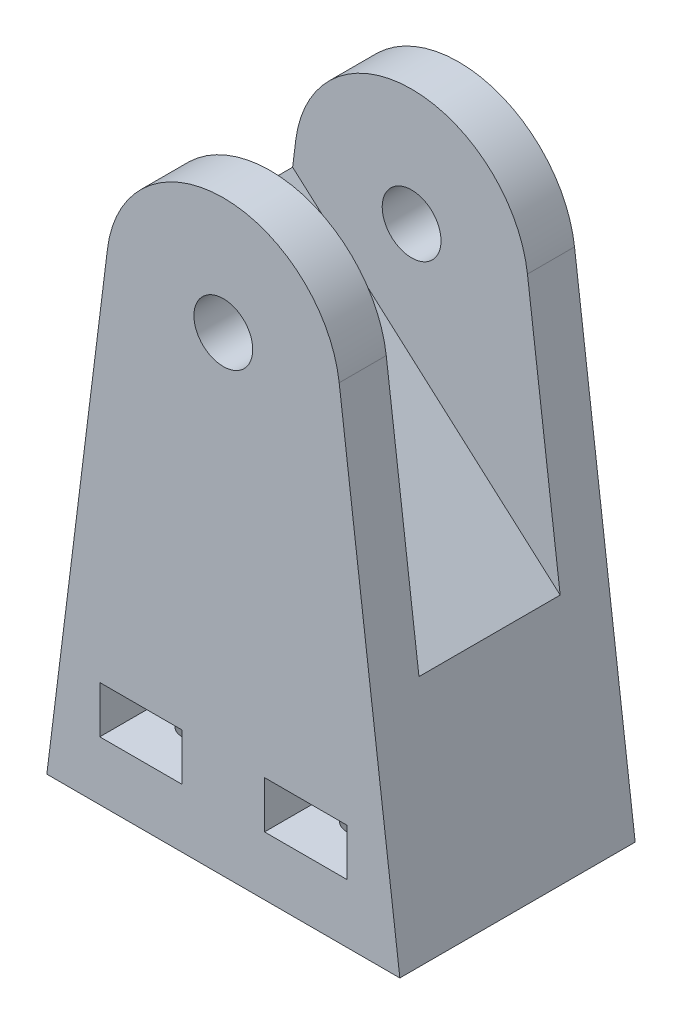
ISO-10303-21;
HEADER;
FILE_DESCRIPTION(('STEP AP214'),'2;1');
FILE_NAME('part.step','',(''),(''),'','','');
FILE_SCHEMA(('AUTOMOTIVE_DESIGN { 1 0 10303 214 1 1 1 1 }'));
ENDSEC;
DATA;
#1=APPLICATION_CONTEXT('core data for automotive mechanical design processes');
#2=APPLICATION_PROTOCOL_DEFINITION('international standard','automotive_design',2000,#1);
#3=PRODUCT_CONTEXT('',#1,'mechanical');
#4=PRODUCT('Part','Part','',(#3));
#5=PRODUCT_RELATED_PRODUCT_CATEGORY('part','',(#4));
#6=PRODUCT_DEFINITION_FORMATION('','',#4);
#7=PRODUCT_DEFINITION_CONTEXT('part definition',#1,'design');
#8=PRODUCT_DEFINITION('design','',#6,#7);
#9=PRODUCT_DEFINITION_SHAPE('','',#8);
#10=(LENGTH_UNIT() NAMED_UNIT(*) SI_UNIT(.MILLI.,.METRE.));
#11=(NAMED_UNIT(*) PLANE_ANGLE_UNIT() SI_UNIT($,.RADIAN.));
#12=(NAMED_UNIT(*) SI_UNIT($,.STERADIAN.) SOLID_ANGLE_UNIT());
#13=UNCERTAINTY_MEASURE_WITH_UNIT(LENGTH_MEASURE(1.E-05),#10,'distance_accuracy_value','');
#14=(GEOMETRIC_REPRESENTATION_CONTEXT(3) GLOBAL_UNCERTAINTY_ASSIGNED_CONTEXT((#13)) GLOBAL_UNIT_ASSIGNED_CONTEXT((#10,
#11,#12)) REPRESENTATION_CONTEXT('',''));
#15=CARTESIAN_POINT('',(0.,0.,0.));
#16=DIRECTION('',(0.,0.,1.));
#17=DIRECTION('',(1.,0.,0.));
#18=AXIS2_PLACEMENT_3D('',#15,#16,#17);
#19=CARTESIAN_POINT('',(0.,0.,20.));
#20=DIRECTION('',(0.,0.,1.));
#21=DIRECTION('',(1.,0.,0.));
#22=AXIS2_PLACEMENT_3D('',#19,#20,#21);
#23=PLANE('',#22);
#24=DIRECTION('',(0.,1.,0.));
#25=VECTOR('',#24,1.);
#26=CARTESIAN_POINT('',(-10.5,0.,20.));
#27=LINE('',#26,#25);
#28=CARTESIAN_POINT('',(-10.5,-15.,20.));
#29=VERTEX_POINT('',#28);
#30=CARTESIAN_POINT('',(-10.5,-11.,20.));
#31=VERTEX_POINT('',#30);
#32=EDGE_CURVE('E234',#29,#31,#27,.T.);
#33=ORIENTED_EDGE('',*,*,#32,.T.);
#34=DIRECTION('',(1.,0.,0.));
#35=VECTOR('',#34,1.);
#36=CARTESIAN_POINT('',(0.,-11.,20.));
#37=LINE('',#36,#35);
#38=CARTESIAN_POINT('',(-3.49999999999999,-11.,20.));
#39=VERTEX_POINT('',#38);
#40=EDGE_CURVE('E229',#31,#39,#37,.T.);
#41=ORIENTED_EDGE('',*,*,#40,.T.);
#42=DIRECTION('',(0.,1.,0.));
#43=VECTOR('',#42,1.);
#44=CARTESIAN_POINT('',(-3.49999999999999,0.,20.));
#45=LINE('',#44,#43);
#46=CARTESIAN_POINT('',(-3.49999999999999,-15.,20.));
#47=VERTEX_POINT('',#46);
#48=EDGE_CURVE('E232',#47,#39,#45,.T.);
#49=ORIENTED_EDGE('',*,*,#48,.F.);
#50=DIRECTION('',(1.,0.,0.));
#51=VECTOR('',#50,1.);
#52=CARTESIAN_POINT('',(0.,-15.,20.));
#53=LINE('',#52,#51);
#54=EDGE_CURVE('E222',#29,#47,#53,.T.);
#55=ORIENTED_EDGE('',*,*,#54,.F.);
#56=EDGE_LOOP('',(#33,#41,#49,#55));
#57=FACE_BOUND('',#56,.T.);
#58=DIRECTION('',(-0.124034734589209,0.992277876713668,0.));
#59=VECTOR('',#58,1.);
#60=CARTESIAN_POINT('',(12.3076923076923,1.53846153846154,20.));
#61=LINE('',#60,#59);
#62=CARTESIAN_POINT('',(15.,-20.,20.));
#63=VERTEX_POINT('',#62);
#64=CARTESIAN_POINT('',(9.84615384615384,21.2307692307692,20.));
#65=VERTEX_POINT('',#64);
#66=EDGE_CURVE('E322',#63,#65,#61,.T.);
#67=ORIENTED_EDGE('',*,*,#66,.T.);
#68=CARTESIAN_POINT('',(0.,20.,20.));
#69=DIRECTION('',(0.,0.,1.));
#70=DIRECTION('',(1.,0.,0.));
#71=AXIS2_PLACEMENT_3D('',#68,#69,#70);
#72=CIRCLE('',#71,9.92277876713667);
#73=CARTESIAN_POINT('',(-9.84615384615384,21.2307692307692,20.));
#74=VERTEX_POINT('',#73);
#75=EDGE_CURVE('E248',#65,#74,#72,.T.);
#76=ORIENTED_EDGE('',*,*,#75,.T.);
#77=DIRECTION('',(0.124034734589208,0.992277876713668,0.));
#78=VECTOR('',#77,1.);
#79=CARTESIAN_POINT('',(-12.3076923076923,1.53846153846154,20.));
#80=LINE('',#79,#78);
#81=CARTESIAN_POINT('',(-15.,-20.,20.));
#82=VERTEX_POINT('',#81);
#83=EDGE_CURVE('E316',#82,#74,#80,.T.);
#84=ORIENTED_EDGE('',*,*,#83,.F.);
#85=DIRECTION('',(-1.,0.,0.));
#86=VECTOR('',#85,1.);
#87=CARTESIAN_POINT('',(0.,-20.,20.));
#88=LINE('',#87,#86);
#89=EDGE_CURVE('E319',#63,#82,#88,.T.);
#90=ORIENTED_EDGE('',*,*,#89,.F.);
#91=EDGE_LOOP('',(#67,#76,#84,#90));
#92=FACE_BOUND('',#91,.T.);
#93=CARTESIAN_POINT('',(0.,20.,20.));
#94=DIRECTION('',(0.,0.,1.));
#95=DIRECTION('',(1.,0.,0.));
#96=AXIS2_PLACEMENT_3D('',#93,#94,#95);
#97=CIRCLE('',#96,2.5);
#98=CARTESIAN_POINT('',(2.5,20.,20.));
#99=VERTEX_POINT('',#98);
#100=EDGE_CURVE('E313',#99,#99,#97,.T.);
#101=ORIENTED_EDGE('',*,*,#100,.F.);
#102=EDGE_LOOP('',(#101));
#103=FACE_BOUND('',#102,.T.);
#104=DIRECTION('',(0.,1.,0.));
#105=VECTOR('',#104,1.);
#106=CARTESIAN_POINT('',(3.5,0.,20.));
#107=LINE('',#106,#105);
#108=CARTESIAN_POINT('',(3.5,-15.,20.));
#109=VERTEX_POINT('',#108);
#110=CARTESIAN_POINT('',(3.5,-11.,20.));
#111=VERTEX_POINT('',#110);
#112=EDGE_CURVE('E194',#109,#111,#107,.T.);
#113=ORIENTED_EDGE('',*,*,#112,.T.);
#114=DIRECTION('',(1.,0.,0.));
#115=VECTOR('',#114,1.);
#116=CARTESIAN_POINT('',(0.,-11.,20.));
#117=LINE('',#116,#115);
#118=CARTESIAN_POINT('',(10.5,-11.,20.));
#119=VERTEX_POINT('',#118);
#120=EDGE_CURVE('E189',#111,#119,#117,.T.);
#121=ORIENTED_EDGE('',*,*,#120,.T.);
#122=DIRECTION('',(0.,1.,0.));
#123=VECTOR('',#122,1.);
#124=CARTESIAN_POINT('',(10.5,0.,20.));
#125=LINE('',#124,#123);
#126=CARTESIAN_POINT('',(10.5,-15.,20.));
#127=VERTEX_POINT('',#126);
#128=EDGE_CURVE('E192',#127,#119,#125,.T.);
#129=ORIENTED_EDGE('',*,*,#128,.F.);
#130=DIRECTION('',(1.,0.,0.));
#131=VECTOR('',#130,1.);
#132=CARTESIAN_POINT('',(0.,-15.,20.));
#133=LINE('',#132,#131);
#134=EDGE_CURVE('E160',#109,#127,#133,.T.);
#135=ORIENTED_EDGE('',*,*,#134,.F.);
#136=EDGE_LOOP('',(#113,#121,#129,#135));
#137=FACE_BOUND('',#136,.T.);
#138=ADVANCED_FACE('F39',(#57,#92,#103,#137),#23,.T.);
#139=CARTESIAN_POINT('',(0.,0.,0.));
#140=DIRECTION('',(0.,0.,1.));
#141=DIRECTION('',(1.,0.,0.));
#142=AXIS2_PLACEMENT_3D('',#139,#140,#141);
#143=PLANE('',#142);
#144=DIRECTION('',(-1.,0.,0.));
#145=VECTOR('',#144,1.);
#146=CARTESIAN_POINT('',(0.,-11.,0.));
#147=LINE('',#146,#145);
#148=CARTESIAN_POINT('',(-3.49999999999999,-11.,0.));
#149=VERTEX_POINT('',#148);
#150=CARTESIAN_POINT('',(-10.5,-11.,0.));
#151=VERTEX_POINT('',#150);
#152=EDGE_CURVE('E197',#149,#151,#147,.T.);
#153=ORIENTED_EDGE('',*,*,#152,.T.);
#154=DIRECTION('',(0.,-1.,0.));
#155=VECTOR('',#154,1.);
#156=CARTESIAN_POINT('',(-10.5,0.,0.));
#157=LINE('',#156,#155);
#158=CARTESIAN_POINT('',(-10.5,-15.,0.));
#159=VERTEX_POINT('',#158);
#160=EDGE_CURVE('E206',#151,#159,#157,.T.);
#161=ORIENTED_EDGE('',*,*,#160,.T.);
#162=DIRECTION('',(-1.,0.,0.));
#163=VECTOR('',#162,1.);
#164=CARTESIAN_POINT('',(0.,-15.,0.));
#165=LINE('',#164,#163);
#166=CARTESIAN_POINT('',(-3.49999999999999,-15.,0.));
#167=VERTEX_POINT('',#166);
#168=EDGE_CURVE('E203',#167,#159,#165,.T.);
#169=ORIENTED_EDGE('',*,*,#168,.F.);
#170=DIRECTION('',(0.,-1.,0.));
#171=VECTOR('',#170,1.);
#172=CARTESIAN_POINT('',(-3.49999999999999,0.,0.));
#173=LINE('',#172,#171);
#174=EDGE_CURVE('E200',#149,#167,#173,.T.);
#175=ORIENTED_EDGE('',*,*,#174,.F.);
#176=EDGE_LOOP('',(#153,#161,#169,#175));
#177=FACE_BOUND('',#176,.T.);
#178=CARTESIAN_POINT('',(0.,20.,0.));
#179=DIRECTION('',(0.,0.,-1.));
#180=DIRECTION('',(-1.,0.,0.));
#181=AXIS2_PLACEMENT_3D('',#178,#179,#180);
#182=CIRCLE('',#181,9.92277876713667);
#183=CARTESIAN_POINT('',(-9.84615384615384,21.2307692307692,0.));
#184=VERTEX_POINT('',#183);
#185=CARTESIAN_POINT('',(9.84615384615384,21.2307692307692,0.));
#186=VERTEX_POINT('',#185);
#187=EDGE_CURVE('E258',#184,#186,#182,.T.);
#188=ORIENTED_EDGE('',*,*,#187,.T.);
#189=DIRECTION('',(-0.124034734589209,0.992277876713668,0.));
#190=VECTOR('',#189,1.);
#191=CARTESIAN_POINT('',(12.3076923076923,1.53846153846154,0.));
#192=LINE('',#191,#190);
#193=CARTESIAN_POINT('',(15.,-20.,0.));
#194=VERTEX_POINT('',#193);
#195=EDGE_CURVE('E317',#194,#186,#192,.T.);
#196=ORIENTED_EDGE('',*,*,#195,.F.);
#197=DIRECTION('',(-1.,0.,0.));
#198=VECTOR('',#197,1.);
#199=CARTESIAN_POINT('',(0.,-20.,0.));
#200=LINE('',#199,#198);
#201=CARTESIAN_POINT('',(-15.,-20.,0.));
#202=VERTEX_POINT('',#201);
#203=EDGE_CURVE('E328',#194,#202,#200,.T.);
#204=ORIENTED_EDGE('',*,*,#203,.T.);
#205=DIRECTION('',(0.124034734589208,0.992277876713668,0.));
#206=VECTOR('',#205,1.);
#207=CARTESIAN_POINT('',(-12.3076923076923,1.53846153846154,0.));
#208=LINE('',#207,#206);
#209=EDGE_CURVE('E326',#202,#184,#208,.T.);
#210=ORIENTED_EDGE('',*,*,#209,.T.);
#211=EDGE_LOOP('',(#188,#196,#204,#210));
#212=FACE_BOUND('',#211,.T.);
#213=CARTESIAN_POINT('',(0.,20.,0.));
#214=DIRECTION('',(0.,0.,1.));
#215=DIRECTION('',(1.,0.,0.));
#216=AXIS2_PLACEMENT_3D('',#213,#214,#215);
#217=CIRCLE('',#216,2.5);
#218=CARTESIAN_POINT('',(2.5,20.,0.));
#219=VERTEX_POINT('',#218);
#220=EDGE_CURVE('E312',#219,#219,#217,.T.);
#221=ORIENTED_EDGE('',*,*,#220,.T.);
#222=EDGE_LOOP('',(#221));
#223=FACE_BOUND('',#222,.T.);
#224=DIRECTION('',(-1.,0.,0.));
#225=VECTOR('',#224,1.);
#226=CARTESIAN_POINT('',(0.,-11.,0.));
#227=LINE('',#226,#225);
#228=CARTESIAN_POINT('',(10.5,-11.,0.));
#229=VERTEX_POINT('',#228);
#230=CARTESIAN_POINT('',(3.5,-11.,0.));
#231=VERTEX_POINT('',#230);
#232=EDGE_CURVE('E64',#229,#231,#227,.T.);
#233=ORIENTED_EDGE('',*,*,#232,.T.);
#234=DIRECTION('',(0.,-1.,0.));
#235=VECTOR('',#234,1.);
#236=CARTESIAN_POINT('',(3.5,0.,0.));
#237=LINE('',#236,#235);
#238=CARTESIAN_POINT('',(3.5,-15.,0.));
#239=VERTEX_POINT('',#238);
#240=EDGE_CURVE('E172',#231,#239,#237,.T.);
#241=ORIENTED_EDGE('',*,*,#240,.T.);
#242=DIRECTION('',(-1.,0.,0.));
#243=VECTOR('',#242,1.);
#244=CARTESIAN_POINT('',(0.,-15.,0.));
#245=LINE('',#244,#243);
#246=CARTESIAN_POINT('',(10.5,-15.,0.));
#247=VERTEX_POINT('',#246);
#248=EDGE_CURVE('E157',#247,#239,#245,.T.);
#249=ORIENTED_EDGE('',*,*,#248,.F.);
#250=DIRECTION('',(0.,-1.,0.));
#251=VECTOR('',#250,1.);
#252=CARTESIAN_POINT('',(10.5,0.,0.));
#253=LINE('',#252,#251);
#254=EDGE_CURVE('E166',#229,#247,#253,.T.);
#255=ORIENTED_EDGE('',*,*,#254,.F.);
#256=EDGE_LOOP('',(#233,#241,#249,#255));
#257=FACE_BOUND('',#256,.T.);
#258=ADVANCED_FACE('F170',(#177,#212,#223,#257),#143,.F.);
#259=CARTESIAN_POINT('',(0.,46.,4.));
#260=DIRECTION('',(0.,0.,-1.));
#261=DIRECTION('',(-1.,0.,0.));
#262=AXIS2_PLACEMENT_3D('',#259,#260,#261);
#263=PLANE('',#262);
#264=CARTESIAN_POINT('',(0.,20.,4.));
#265=DIRECTION('',(0.,0.,-1.));
#266=DIRECTION('',(-1.,0.,0.));
#267=AXIS2_PLACEMENT_3D('',#264,#265,#266);
#268=CIRCLE('',#267,2.5);
#269=CARTESIAN_POINT('',(-2.5,20.,4.));
#270=VERTEX_POINT('',#269);
#271=EDGE_CURVE('E309',#270,#270,#268,.T.);
#272=ORIENTED_EDGE('',*,*,#271,.T.);
#273=EDGE_LOOP('',(#272));
#274=FACE_BOUND('',#273,.T.);
#275=DIRECTION('',(-0.748812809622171,0.662781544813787,0.));
#276=VECTOR('',#275,1.);
#277=CARTESIAN_POINT('',(5.04675335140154,5.70183884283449,4.));
#278=LINE('',#277,#276);
#279=CARTESIAN_POINT('',(12.6258069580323,-1.00645566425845,4.));
#280=VERTEX_POINT('',#279);
#281=CARTESIAN_POINT('',(-10.1103118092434,19.1175055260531,4.));
#282=VERTEX_POINT('',#281);
#283=EDGE_CURVE('E237',#280,#282,#278,.T.);
#284=ORIENTED_EDGE('',*,*,#283,.F.);
#285=DIRECTION('',(0.124034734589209,-0.992277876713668,0.));
#286=VECTOR('',#285,1.);
#287=CARTESIAN_POINT('',(12.3076923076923,1.53846153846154,4.));
#288=LINE('',#287,#286);
#289=CARTESIAN_POINT('',(9.84615384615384,21.2307692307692,4.));
#290=VERTEX_POINT('',#289);
#291=EDGE_CURVE('E304',#290,#280,#288,.T.);
#292=ORIENTED_EDGE('',*,*,#291,.F.);
#293=CARTESIAN_POINT('',(0.,20.,4.));
#294=DIRECTION('',(0.,0.,-1.));
#295=DIRECTION('',(-1.,0.,0.));
#296=AXIS2_PLACEMENT_3D('',#293,#294,#295);
#297=CIRCLE('',#296,9.92277876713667);
#298=CARTESIAN_POINT('',(-9.84615384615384,21.2307692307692,4.));
#299=VERTEX_POINT('',#298);
#300=EDGE_CURVE('E261',#299,#290,#297,.T.);
#301=ORIENTED_EDGE('',*,*,#300,.F.);
#302=DIRECTION('',(-0.124034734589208,-0.992277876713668,0.));
#303=VECTOR('',#302,1.);
#304=CARTESIAN_POINT('',(-12.3076923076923,1.53846153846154,4.));
#305=LINE('',#304,#303);
#306=EDGE_CURVE('E307',#299,#282,#305,.T.);
#307=ORIENTED_EDGE('',*,*,#306,.T.);
#308=EDGE_LOOP('',(#284,#292,#301,#307));
#309=FACE_BOUND('',#308,.T.);
#310=ADVANCED_FACE('F382',(#274,#309),#263,.F.);
#311=CARTESIAN_POINT('',(0.,46.,16.));
#312=DIRECTION('',(0.,0.,-1.));
#313=DIRECTION('',(-1.,0.,0.));
#314=AXIS2_PLACEMENT_3D('',#311,#312,#313);
#315=PLANE('',#314);
#316=CARTESIAN_POINT('',(0.,20.,16.));
#317=DIRECTION('',(0.,0.,-1.));
#318=DIRECTION('',(-1.,0.,0.));
#319=AXIS2_PLACEMENT_3D('',#316,#317,#318);
#320=CIRCLE('',#319,2.5);
#321=CARTESIAN_POINT('',(-2.5,20.,16.));
#322=VERTEX_POINT('',#321);
#323=EDGE_CURVE('E301',#322,#322,#320,.T.);
#324=ORIENTED_EDGE('',*,*,#323,.F.);
#325=EDGE_LOOP('',(#324));
#326=FACE_BOUND('',#325,.T.);
#327=DIRECTION('',(0.124034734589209,-0.992277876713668,0.));
#328=VECTOR('',#327,1.);
#329=CARTESIAN_POINT('',(12.3076923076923,1.53846153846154,16.));
#330=LINE('',#329,#328);
#331=CARTESIAN_POINT('',(9.84615384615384,21.2307692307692,16.));
#332=VERTEX_POINT('',#331);
#333=CARTESIAN_POINT('',(12.6258069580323,-1.00645566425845,16.));
#334=VERTEX_POINT('',#333);
#335=EDGE_CURVE('E294',#332,#334,#330,.T.);
#336=ORIENTED_EDGE('',*,*,#335,.T.);
#337=DIRECTION('',(-0.748812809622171,0.662781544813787,0.));
#338=VECTOR('',#337,1.);
#339=CARTESIAN_POINT('',(5.04675335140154,5.70183884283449,16.));
#340=LINE('',#339,#338);
#341=CARTESIAN_POINT('',(-10.1103118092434,19.1175055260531,16.));
#342=VERTEX_POINT('',#341);
#343=EDGE_CURVE('E238',#334,#342,#340,.T.);
#344=ORIENTED_EDGE('',*,*,#343,.T.);
#345=DIRECTION('',(-0.124034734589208,-0.992277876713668,0.));
#346=VECTOR('',#345,1.);
#347=CARTESIAN_POINT('',(-12.3076923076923,1.53846153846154,16.));
#348=LINE('',#347,#346);
#349=CARTESIAN_POINT('',(-9.84615384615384,21.2307692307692,16.));
#350=VERTEX_POINT('',#349);
#351=EDGE_CURVE('E298',#350,#342,#348,.T.);
#352=ORIENTED_EDGE('',*,*,#351,.F.);
#353=CARTESIAN_POINT('',(0.,20.,16.));
#354=DIRECTION('',(0.,0.,1.));
#355=DIRECTION('',(1.,0.,0.));
#356=AXIS2_PLACEMENT_3D('',#353,#354,#355);
#357=CIRCLE('',#356,9.92277876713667);
#358=EDGE_CURVE('E249',#332,#350,#357,.T.);
#359=ORIENTED_EDGE('',*,*,#358,.F.);
#360=EDGE_LOOP('',(#336,#344,#352,#359));
#361=FACE_BOUND('',#360,.T.);
#362=ADVANCED_FACE('F388',(#326,#361),#315,.T.);
#363=CARTESIAN_POINT('',(0.,20.,20.));
#364=DIRECTION('',(0.,0.,-1.));
#365=DIRECTION('',(-1.,0.,0.));
#366=AXIS2_PLACEMENT_3D('',#363,#364,#365);
#367=CYLINDRICAL_SURFACE('',#366,2.5);
#368=ORIENTED_EDGE('',*,*,#100,.T.);
#369=EDGE_LOOP('',(#368));
#370=FACE_BOUND('',#369,.T.);
#371=ORIENTED_EDGE('',*,*,#323,.T.);
#372=EDGE_LOOP('',(#371));
#373=FACE_BOUND('',#372,.T.);
#374=ADVANCED_FACE('F446',(#370,#373),#367,.F.);
#375=CARTESIAN_POINT('',(-12.3076923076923,1.53846153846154,20.));
#376=DIRECTION('',(-0.992277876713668,0.124034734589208,0.));
#377=DIRECTION('',(-0.124034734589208,-0.992277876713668,0.));
#378=AXIS2_PLACEMENT_3D('',#375,#376,#377);
#379=PLANE('',#378);
#380=ORIENTED_EDGE('',*,*,#83,.T.);
#381=DIRECTION('',(0.,0.,1.));
#382=VECTOR('',#381,1.);
#383=CARTESIAN_POINT('',(-9.84615384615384,21.2307692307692,16.));
#384=LINE('',#383,#382);
#385=EDGE_CURVE('E255',#350,#74,#384,.T.);
#386=ORIENTED_EDGE('',*,*,#385,.F.);
#387=ORIENTED_EDGE('',*,*,#351,.T.);
#388=DIRECTION('',(0.,0.,-1.));
#389=VECTOR('',#388,1.);
#390=CARTESIAN_POINT('',(-10.1103118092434,19.1175055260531,16.));
#391=LINE('',#390,#389);
#392=EDGE_CURVE('E240',#342,#282,#391,.T.);
#393=ORIENTED_EDGE('',*,*,#392,.T.);
#394=ORIENTED_EDGE('',*,*,#306,.F.);
#395=DIRECTION('',(0.,0.,-1.));
#396=VECTOR('',#395,1.);
#397=CARTESIAN_POINT('',(-9.84615384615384,21.2307692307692,4.));
#398=LINE('',#397,#396);
#399=EDGE_CURVE('E264',#299,#184,#398,.T.);
#400=ORIENTED_EDGE('',*,*,#399,.T.);
#401=ORIENTED_EDGE('',*,*,#209,.F.);
#402=DIRECTION('',(0.,0.,-1.));
#403=VECTOR('',#402,1.);
#404=CARTESIAN_POINT('',(-15.,-20.,20.));
#405=LINE('',#404,#403);
#406=EDGE_CURVE('E12',#82,#202,#405,.T.);
#407=ORIENTED_EDGE('',*,*,#406,.F.);
#408=EDGE_LOOP('',(#380,#386,#387,#393,#394,#400,#401,#407));
#409=FACE_BOUND('',#408,.T.);
#410=ADVANCED_FACE('F359',(#409),#379,.T.);
#411=CARTESIAN_POINT('',(0.,-20.,20.));
#412=DIRECTION('',(0.,-1.,0.));
#413=DIRECTION('',(0.,0.,-1.));
#414=AXIS2_PLACEMENT_3D('',#411,#412,#413);
#415=PLANE('',#414);
#416=CARTESIAN_POINT('',(7.00000000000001,-20.,15.));
#417=DIRECTION('',(0.,-1.,0.));
#418=DIRECTION('',(0.,0.,-1.));
#419=AXIS2_PLACEMENT_3D('',#416,#417,#418);
#420=CIRCLE('',#419,1.5);
#421=CARTESIAN_POINT('',(7.00000000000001,-20.,13.5));
#422=VERTEX_POINT('',#421);
#423=EDGE_CURVE('E270',#422,#422,#420,.T.);
#424=ORIENTED_EDGE('',*,*,#423,.F.);
#425=EDGE_LOOP('',(#424));
#426=FACE_BOUND('',#425,.T.);
#427=CARTESIAN_POINT('',(7.00000000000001,-20.,5.));
#428=DIRECTION('',(0.,-1.,0.));
#429=DIRECTION('',(0.,0.,-1.));
#430=AXIS2_PLACEMENT_3D('',#427,#428,#429);
#431=CIRCLE('',#430,1.5);
#432=CARTESIAN_POINT('',(7.00000000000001,-20.,3.5));
#433=VERTEX_POINT('',#432);
#434=EDGE_CURVE('E276',#433,#433,#431,.T.);
#435=ORIENTED_EDGE('',*,*,#434,.F.);
#436=EDGE_LOOP('',(#435));
#437=FACE_BOUND('',#436,.T.);
#438=CARTESIAN_POINT('',(-6.99999999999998,-20.,5.));
#439=DIRECTION('',(0.,-1.,0.));
#440=DIRECTION('',(0.,0.,-1.));
#441=AXIS2_PLACEMENT_3D('',#438,#439,#440);
#442=CIRCLE('',#441,1.5);
#443=CARTESIAN_POINT('',(-6.99999999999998,-20.,3.5));
#444=VERTEX_POINT('',#443);
#445=EDGE_CURVE('E282',#444,#444,#442,.T.);
#446=ORIENTED_EDGE('',*,*,#445,.F.);
#447=EDGE_LOOP('',(#446));
#448=FACE_BOUND('',#447,.T.);
#449=CARTESIAN_POINT('',(-6.99999999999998,-20.,15.));
#450=DIRECTION('',(0.,-1.,0.));
#451=DIRECTION('',(0.,0.,-1.));
#452=AXIS2_PLACEMENT_3D('',#449,#450,#451);
#453=CIRCLE('',#452,1.5);
#454=CARTESIAN_POINT('',(-6.99999999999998,-20.,13.5));
#455=VERTEX_POINT('',#454);
#456=EDGE_CURVE('E288',#455,#455,#453,.T.);
#457=ORIENTED_EDGE('',*,*,#456,.F.);
#458=EDGE_LOOP('',(#457));
#459=FACE_BOUND('',#458,.T.);
#460=ORIENTED_EDGE('',*,*,#203,.F.);
#461=DIRECTION('',(0.,0.,-1.));
#462=VECTOR('',#461,1.);
#463=CARTESIAN_POINT('',(15.,-20.,20.));
#464=LINE('',#463,#462);
#465=EDGE_CURVE('E48',#63,#194,#464,.T.);
#466=ORIENTED_EDGE('',*,*,#465,.F.);
#467=ORIENTED_EDGE('',*,*,#89,.T.);
#468=ORIENTED_EDGE('',*,*,#406,.T.);
#469=EDGE_LOOP('',(#460,#466,#467,#468));
#470=FACE_BOUND('',#469,.T.);
#471=ADVANCED_FACE('F356',(#426,#437,#448,#459,#470),#415,.T.);
#472=ORIENTED_EDGE('',*,*,#271,.F.);
#473=EDGE_LOOP('',(#472));
#474=FACE_BOUND('',#473,.T.);
#475=ORIENTED_EDGE('',*,*,#220,.F.);
#476=EDGE_LOOP('',(#475));
#477=FACE_BOUND('',#476,.T.);
#478=ADVANCED_FACE('F41',(#474,#477),#367,.F.);
#479=CARTESIAN_POINT('',(12.3076923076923,1.53846153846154,20.));
#480=DIRECTION('',(-0.992277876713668,-0.124034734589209,0.));
#481=DIRECTION('',(0.124034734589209,-0.992277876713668,0.));
#482=AXIS2_PLACEMENT_3D('',#479,#480,#481);
#483=PLANE('',#482);
#484=DIRECTION('',(0.,0.,-1.));
#485=VECTOR('',#484,1.);
#486=CARTESIAN_POINT('',(12.6258069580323,-1.00645566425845,16.));
#487=LINE('',#486,#485);
#488=EDGE_CURVE('E245',#334,#280,#487,.T.);
#489=ORIENTED_EDGE('',*,*,#488,.F.);
#490=ORIENTED_EDGE('',*,*,#335,.F.);
#491=DIRECTION('',(0.,0.,1.));
#492=VECTOR('',#491,1.);
#493=CARTESIAN_POINT('',(9.84615384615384,21.2307692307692,16.));
#494=LINE('',#493,#492);
#495=EDGE_CURVE('E252',#332,#65,#494,.T.);
#496=ORIENTED_EDGE('',*,*,#495,.T.);
#497=ORIENTED_EDGE('',*,*,#66,.F.);
#498=ORIENTED_EDGE('',*,*,#465,.T.);
#499=ORIENTED_EDGE('',*,*,#195,.T.);
#500=DIRECTION('',(0.,0.,-1.));
#501=VECTOR('',#500,1.);
#502=CARTESIAN_POINT('',(9.84615384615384,21.2307692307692,4.));
#503=LINE('',#502,#501);
#504=EDGE_CURVE('E267',#290,#186,#503,.T.);
#505=ORIENTED_EDGE('',*,*,#504,.F.);
#506=ORIENTED_EDGE('',*,*,#291,.T.);
#507=EDGE_LOOP('',(#489,#490,#496,#497,#498,#499,#505,#506));
#508=FACE_BOUND('',#507,.T.);
#509=ADVANCED_FACE('F376',(#508),#483,.F.);
#510=CARTESIAN_POINT('',(-6.99999999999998,0.,15.));
#511=DIRECTION('',(0.,-1.,0.));
#512=DIRECTION('',(0.,0.,-1.));
#513=AXIS2_PLACEMENT_3D('',#510,#511,#512);
#514=CYLINDRICAL_SURFACE('',#513,1.5);
#515=CARTESIAN_POINT('',(-6.99999999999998,-15.,15.));
#516=DIRECTION('',(0.,-1.,0.));
#517=DIRECTION('',(0.,0.,-1.));
#518=AXIS2_PLACEMENT_3D('',#515,#516,#517);
#519=CIRCLE('',#518,1.5);
#520=CARTESIAN_POINT('',(-6.99999999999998,-15.,13.5));
#521=VERTEX_POINT('',#520);
#522=EDGE_CURVE('E219',#521,#521,#519,.F.);
#523=ORIENTED_EDGE('',*,*,#522,.T.);
#524=EDGE_LOOP('',(#523));
#525=FACE_BOUND('',#524,.T.);
#526=ORIENTED_EDGE('',*,*,#456,.T.);
#527=EDGE_LOOP('',(#526));
#528=FACE_BOUND('',#527,.T.);
#529=ADVANCED_FACE('F443',(#525,#528),#514,.F.);
#530=CARTESIAN_POINT('',(-6.99999999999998,0.,5.));
#531=DIRECTION('',(0.,-1.,0.));
#532=DIRECTION('',(0.,0.,-1.));
#533=AXIS2_PLACEMENT_3D('',#530,#531,#532);
#534=CYLINDRICAL_SURFACE('',#533,1.5);
#535=CARTESIAN_POINT('',(-6.99999999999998,-15.,5.));
#536=DIRECTION('',(0.,-1.,0.));
#537=DIRECTION('',(0.,0.,-1.));
#538=AXIS2_PLACEMENT_3D('',#535,#536,#537);
#539=CIRCLE('',#538,1.5);
#540=CARTESIAN_POINT('',(-6.99999999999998,-15.,3.5));
#541=VERTEX_POINT('',#540);
#542=EDGE_CURVE('E212',#541,#541,#539,.F.);
#543=ORIENTED_EDGE('',*,*,#542,.T.);
#544=EDGE_LOOP('',(#543));
#545=FACE_BOUND('',#544,.T.);
#546=ORIENTED_EDGE('',*,*,#445,.T.);
#547=EDGE_LOOP('',(#546));
#548=FACE_BOUND('',#547,.T.);
#549=ADVANCED_FACE('F351',(#545,#548),#534,.F.);
#550=CARTESIAN_POINT('',(7.00000000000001,0.,5.));
#551=DIRECTION('',(0.,-1.,0.));
#552=DIRECTION('',(0.,0.,-1.));
#553=AXIS2_PLACEMENT_3D('',#550,#551,#552);
#554=CYLINDRICAL_SURFACE('',#553,1.5);
#555=CARTESIAN_POINT('',(7.00000000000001,-15.,5.));
#556=DIRECTION('',(0.,-1.,0.));
#557=DIRECTION('',(0.,0.,-1.));
#558=AXIS2_PLACEMENT_3D('',#555,#556,#557);
#559=CIRCLE('',#558,1.5);
#560=CARTESIAN_POINT('',(7.00000000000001,-15.,3.5));
#561=VERTEX_POINT('',#560);
#562=EDGE_CURVE('E182',#561,#561,#559,.F.);
#563=ORIENTED_EDGE('',*,*,#562,.T.);
#564=EDGE_LOOP('',(#563));
#565=FACE_BOUND('',#564,.T.);
#566=ORIENTED_EDGE('',*,*,#434,.T.);
#567=EDGE_LOOP('',(#566));
#568=FACE_BOUND('',#567,.T.);
#569=ADVANCED_FACE('F348',(#565,#568),#554,.F.);
#570=CARTESIAN_POINT('',(7.00000000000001,0.,15.));
#571=DIRECTION('',(0.,-1.,0.));
#572=DIRECTION('',(0.,0.,-1.));
#573=AXIS2_PLACEMENT_3D('',#570,#571,#572);
#574=CYLINDRICAL_SURFACE('',#573,1.5);
#575=CARTESIAN_POINT('',(7.00000000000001,-15.,15.));
#576=DIRECTION('',(0.,-1.,0.));
#577=DIRECTION('',(0.,0.,-1.));
#578=AXIS2_PLACEMENT_3D('',#575,#576,#577);
#579=CIRCLE('',#578,1.5);
#580=CARTESIAN_POINT('',(7.00000000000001,-15.,13.5));
#581=VERTEX_POINT('',#580);
#582=EDGE_CURVE('E179',#581,#581,#579,.F.);
#583=ORIENTED_EDGE('',*,*,#582,.T.);
#584=EDGE_LOOP('',(#583));
#585=FACE_BOUND('',#584,.T.);
#586=ORIENTED_EDGE('',*,*,#423,.T.);
#587=EDGE_LOOP('',(#586));
#588=FACE_BOUND('',#587,.T.);
#589=ADVANCED_FACE('F339',(#585,#588),#574,.F.);
#590=CARTESIAN_POINT('',(0.,20.,4.));
#591=DIRECTION('',(0.,0.,-1.));
#592=DIRECTION('',(-1.,0.,0.));
#593=AXIS2_PLACEMENT_3D('',#590,#591,#592);
#594=CYLINDRICAL_SURFACE('',#593,9.92277876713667);
#595=ORIENTED_EDGE('',*,*,#187,.F.);
#596=ORIENTED_EDGE('',*,*,#399,.F.);
#597=ORIENTED_EDGE('',*,*,#300,.T.);
#598=ORIENTED_EDGE('',*,*,#504,.T.);
#599=EDGE_LOOP('',(#595,#596,#597,#598));
#600=FACE_BOUND('',#599,.T.);
#601=ADVANCED_FACE('F378',(#600),#594,.T.);
#602=CARTESIAN_POINT('',(0.,20.,16.));
#603=DIRECTION('',(0.,0.,1.));
#604=DIRECTION('',(1.,0.,0.));
#605=AXIS2_PLACEMENT_3D('',#602,#603,#604);
#606=CYLINDRICAL_SURFACE('',#605,9.92277876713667);
#607=ORIENTED_EDGE('',*,*,#75,.F.);
#608=ORIENTED_EDGE('',*,*,#495,.F.);
#609=ORIENTED_EDGE('',*,*,#358,.T.);
#610=ORIENTED_EDGE('',*,*,#385,.T.);
#611=EDGE_LOOP('',(#607,#608,#609,#610));
#612=FACE_BOUND('',#611,.T.);
#613=ADVANCED_FACE('F396',(#612),#606,.T.);
#614=CARTESIAN_POINT('',(5.04675335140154,5.70183884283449,16.));
#615=DIRECTION('',(-0.662781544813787,-0.748812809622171,0.));
#616=DIRECTION('',(0.748812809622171,-0.662781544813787,0.));
#617=AXIS2_PLACEMENT_3D('',#614,#615,#616);
#618=PLANE('',#617);
#619=ORIENTED_EDGE('',*,*,#283,.T.);
#620=ORIENTED_EDGE('',*,*,#392,.F.);
#621=ORIENTED_EDGE('',*,*,#343,.F.);
#622=ORIENTED_EDGE('',*,*,#488,.T.);
#623=EDGE_LOOP('',(#619,#620,#621,#622));
#624=FACE_BOUND('',#623,.T.);
#625=ADVANCED_FACE('F385',(#624),#618,.F.);
#626=CARTESIAN_POINT('',(0.,-11.,24.));
#627=DIRECTION('',(0.,-1.,0.));
#628=DIRECTION('',(0.,0.,-1.));
#629=AXIS2_PLACEMENT_3D('',#626,#627,#628);
#630=PLANE('',#629);
#631=CARTESIAN_POINT('',(-6.99999999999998,-11.,5.));
#632=DIRECTION('',(0.,-1.,0.));
#633=DIRECTION('',(0.,0.,-1.));
#634=AXIS2_PLACEMENT_3D('',#631,#632,#633);
#635=CIRCLE('',#634,1.5);
#636=CARTESIAN_POINT('',(-6.99999999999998,-11.,3.5));
#637=VERTEX_POINT('',#636);
#638=EDGE_CURVE('E225',#637,#637,#635,.F.);
#639=ORIENTED_EDGE('',*,*,#638,.T.);
#640=EDGE_LOOP('',(#639));
#641=FACE_BOUND('',#640,.T.);
#642=DIRECTION('',(0.,0.,-1.));
#643=VECTOR('',#642,1.);
#644=CARTESIAN_POINT('',(-10.5,-11.,24.));
#645=LINE('',#644,#643);
#646=EDGE_CURVE('E210',#31,#151,#645,.T.);
#647=ORIENTED_EDGE('',*,*,#646,.T.);
#648=ORIENTED_EDGE('',*,*,#152,.F.);
#649=DIRECTION('',(0.,0.,-1.));
#650=VECTOR('',#649,1.);
#651=CARTESIAN_POINT('',(-3.49999999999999,-11.,24.));
#652=LINE('',#651,#650);
#653=EDGE_CURVE('E209',#39,#149,#652,.T.);
#654=ORIENTED_EDGE('',*,*,#653,.F.);
#655=ORIENTED_EDGE('',*,*,#40,.F.);
#656=EDGE_LOOP('',(#647,#648,#654,#655));
#657=FACE_BOUND('',#656,.T.);
#658=CARTESIAN_POINT('',(-6.99999999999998,-11.,15.));
#659=DIRECTION('',(0.,-1.,0.));
#660=DIRECTION('',(0.,0.,-1.));
#661=AXIS2_PLACEMENT_3D('',#658,#659,#660);
#662=CIRCLE('',#661,1.5);
#663=CARTESIAN_POINT('',(-6.99999999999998,-11.,13.5));
#664=VERTEX_POINT('',#663);
#665=EDGE_CURVE('E226',#664,#664,#662,.F.);
#666=ORIENTED_EDGE('',*,*,#665,.T.);
#667=EDGE_LOOP('',(#666));
#668=FACE_BOUND('',#667,.T.);
#669=ADVANCED_FACE('F571',(#641,#657,#668),#630,.T.);
#670=CARTESIAN_POINT('',(0.,-15.,24.));
#671=DIRECTION('',(0.,-1.,0.));
#672=DIRECTION('',(0.,0.,-1.));
#673=AXIS2_PLACEMENT_3D('',#670,#671,#672);
#674=PLANE('',#673);
#675=ORIENTED_EDGE('',*,*,#54,.T.);
#676=DIRECTION('',(0.,0.,-1.));
#677=VECTOR('',#676,1.);
#678=CARTESIAN_POINT('',(-3.49999999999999,-15.,24.));
#679=LINE('',#678,#677);
#680=EDGE_CURVE('E215',#47,#167,#679,.T.);
#681=ORIENTED_EDGE('',*,*,#680,.T.);
#682=ORIENTED_EDGE('',*,*,#168,.T.);
#683=DIRECTION('',(0.,0.,-1.));
#684=VECTOR('',#683,1.);
#685=CARTESIAN_POINT('',(-10.5,-15.,24.));
#686=LINE('',#685,#684);
#687=EDGE_CURVE('E213',#29,#159,#686,.T.);
#688=ORIENTED_EDGE('',*,*,#687,.F.);
#689=EDGE_LOOP('',(#675,#681,#682,#688));
#690=FACE_BOUND('',#689,.T.);
#691=ORIENTED_EDGE('',*,*,#542,.F.);
#692=EDGE_LOOP('',(#691));
#693=FACE_BOUND('',#692,.T.);
#694=ORIENTED_EDGE('',*,*,#522,.F.);
#695=EDGE_LOOP('',(#694));
#696=FACE_BOUND('',#695,.T.);
#697=ADVANCED_FACE('F623',(#690,#693,#696),#674,.F.);
#698=CARTESIAN_POINT('',(-10.5,0.,24.));
#699=DIRECTION('',(1.,0.,0.));
#700=DIRECTION('',(0.,0.,-1.));
#701=AXIS2_PLACEMENT_3D('',#698,#699,#700);
#702=PLANE('',#701);
#703=ORIENTED_EDGE('',*,*,#687,.T.);
#704=ORIENTED_EDGE('',*,*,#160,.F.);
#705=ORIENTED_EDGE('',*,*,#646,.F.);
#706=ORIENTED_EDGE('',*,*,#32,.F.);
#707=EDGE_LOOP('',(#703,#704,#705,#706));
#708=FACE_BOUND('',#707,.T.);
#709=ADVANCED_FACE('F635',(#708),#702,.T.);
#710=CARTESIAN_POINT('',(-3.49999999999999,0.,24.));
#711=DIRECTION('',(1.,0.,0.));
#712=DIRECTION('',(0.,0.,-1.));
#713=AXIS2_PLACEMENT_3D('',#710,#711,#712);
#714=PLANE('',#713);
#715=ORIENTED_EDGE('',*,*,#48,.T.);
#716=ORIENTED_EDGE('',*,*,#653,.T.);
#717=ORIENTED_EDGE('',*,*,#174,.T.);
#718=ORIENTED_EDGE('',*,*,#680,.F.);
#719=EDGE_LOOP('',(#715,#716,#717,#718));
#720=FACE_BOUND('',#719,.T.);
#721=ADVANCED_FACE('F431',(#720),#714,.F.);
#722=CARTESIAN_POINT('',(0.,0.,0.));
#723=DIRECTION('',(0.,-1.,0.));
#724=DIRECTION('',(0.,0.,-1.));
#725=AXIS2_PLACEMENT_3D('',#722,#723,#724);
#726=PLANE('',#725);
#727=CARTESIAN_POINT('',(-6.99999999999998,0.,5.));
#728=DIRECTION('',(0.,-1.,0.));
#729=DIRECTION('',(0.,0.,-1.));
#730=AXIS2_PLACEMENT_3D('',#727,#728,#729);
#731=CIRCLE('',#730,1.5);
#732=CARTESIAN_POINT('',(-6.99999999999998,0.,3.5));
#733=VERTEX_POINT('',#732);
#734=EDGE_CURVE('E285',#733,#733,#731,.T.);
#735=ORIENTED_EDGE('',*,*,#734,.T.);
#736=EDGE_LOOP('',(#735));
#737=FACE_BOUND('',#736,.T.);
#738=ADVANCED_FACE('F427',(#737),#726,.T.);
#739=ORIENTED_EDGE('',*,*,#734,.F.);
#740=EDGE_LOOP('',(#739));
#741=FACE_BOUND('',#740,.T.);
#742=ORIENTED_EDGE('',*,*,#638,.F.);
#743=EDGE_LOOP('',(#742));
#744=FACE_BOUND('',#743,.T.);
#745=ADVANCED_FACE('F430',(#741,#744),#534,.F.);
#746=CARTESIAN_POINT('',(0.,0.,0.));
#747=DIRECTION('',(0.,-1.,0.));
#748=DIRECTION('',(0.,0.,-1.));
#749=AXIS2_PLACEMENT_3D('',#746,#747,#748);
#750=PLANE('',#749);
#751=CARTESIAN_POINT('',(-6.99999999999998,0.,15.));
#752=DIRECTION('',(0.,-1.,0.));
#753=DIRECTION('',(0.,0.,-1.));
#754=AXIS2_PLACEMENT_3D('',#751,#752,#753);
#755=CIRCLE('',#754,1.5);
#756=CARTESIAN_POINT('',(-6.99999999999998,0.,13.5));
#757=VERTEX_POINT('',#756);
#758=EDGE_CURVE('E291',#757,#757,#755,.T.);
#759=ORIENTED_EDGE('',*,*,#758,.T.);
#760=EDGE_LOOP('',(#759));
#761=FACE_BOUND('',#760,.T.);
#762=ADVANCED_FACE('F435',(#761),#750,.T.);
#763=ORIENTED_EDGE('',*,*,#758,.F.);
#764=EDGE_LOOP('',(#763));
#765=FACE_BOUND('',#764,.T.);
#766=ORIENTED_EDGE('',*,*,#665,.F.);
#767=EDGE_LOOP('',(#766));
#768=FACE_BOUND('',#767,.T.);
#769=ADVANCED_FACE('F409',(#765,#768),#514,.F.);
#770=CARTESIAN_POINT('',(0.,-11.,24.));
#771=DIRECTION('',(0.,-1.,0.));
#772=DIRECTION('',(0.,0.,-1.));
#773=AXIS2_PLACEMENT_3D('',#770,#771,#772);
#774=PLANE('',#773);
#775=CARTESIAN_POINT('',(7.00000000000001,-11.,15.));
#776=DIRECTION('',(0.,-1.,0.));
#777=DIRECTION('',(0.,0.,-1.));
#778=AXIS2_PLACEMENT_3D('',#775,#776,#777);
#779=CIRCLE('',#778,1.5);
#780=CARTESIAN_POINT('',(7.00000000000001,-11.,13.5));
#781=VERTEX_POINT('',#780);
#782=EDGE_CURVE('E43',#781,#781,#779,.F.);
#783=ORIENTED_EDGE('',*,*,#782,.T.);
#784=EDGE_LOOP('',(#783));
#785=FACE_BOUND('',#784,.T.);
#786=DIRECTION('',(0.,0.,-1.));
#787=VECTOR('',#786,1.);
#788=CARTESIAN_POINT('',(3.5,-11.,24.));
#789=LINE('',#788,#787);
#790=EDGE_CURVE('E177',#111,#231,#789,.T.);
#791=ORIENTED_EDGE('',*,*,#790,.T.);
#792=ORIENTED_EDGE('',*,*,#232,.F.);
#793=DIRECTION('',(0.,0.,-1.));
#794=VECTOR('',#793,1.);
#795=CARTESIAN_POINT('',(10.5,-11.,24.));
#796=LINE('',#795,#794);
#797=EDGE_CURVE('E163',#119,#229,#796,.T.);
#798=ORIENTED_EDGE('',*,*,#797,.F.);
#799=ORIENTED_EDGE('',*,*,#120,.F.);
#800=EDGE_LOOP('',(#791,#792,#798,#799));
#801=FACE_BOUND('',#800,.T.);
#802=CARTESIAN_POINT('',(7.00000000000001,-11.,5.));
#803=DIRECTION('',(0.,-1.,0.));
#804=DIRECTION('',(0.,0.,-1.));
#805=AXIS2_PLACEMENT_3D('',#802,#803,#804);
#806=CIRCLE('',#805,1.5);
#807=CARTESIAN_POINT('',(7.00000000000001,-11.,3.5));
#808=VERTEX_POINT('',#807);
#809=EDGE_CURVE('E186',#808,#808,#806,.F.);
#810=ORIENTED_EDGE('',*,*,#809,.T.);
#811=EDGE_LOOP('',(#810));
#812=FACE_BOUND('',#811,.T.);
#813=ADVANCED_FACE('F344',(#785,#801,#812),#774,.T.);
#814=CARTESIAN_POINT('',(0.,-15.,24.));
#815=DIRECTION('',(0.,-1.,0.));
#816=DIRECTION('',(0.,0.,-1.));
#817=AXIS2_PLACEMENT_3D('',#814,#815,#816);
#818=PLANE('',#817);
#819=ORIENTED_EDGE('',*,*,#134,.T.);
#820=DIRECTION('',(0.,0.,-1.));
#821=VECTOR('',#820,1.);
#822=CARTESIAN_POINT('',(10.5,-15.,24.));
#823=LINE('',#822,#821);
#824=EDGE_CURVE('E56',#127,#247,#823,.T.);
#825=ORIENTED_EDGE('',*,*,#824,.T.);
#826=ORIENTED_EDGE('',*,*,#248,.T.);
#827=DIRECTION('',(0.,0.,-1.));
#828=VECTOR('',#827,1.);
#829=CARTESIAN_POINT('',(3.5,-15.,24.));
#830=LINE('',#829,#828);
#831=EDGE_CURVE('E162',#109,#239,#830,.T.);
#832=ORIENTED_EDGE('',*,*,#831,.F.);
#833=EDGE_LOOP('',(#819,#825,#826,#832));
#834=FACE_BOUND('',#833,.T.);
#835=ORIENTED_EDGE('',*,*,#582,.F.);
#836=EDGE_LOOP('',(#835));
#837=FACE_BOUND('',#836,.T.);
#838=ORIENTED_EDGE('',*,*,#562,.F.);
#839=EDGE_LOOP('',(#838));
#840=FACE_BOUND('',#839,.T.);
#841=ADVANCED_FACE('F153',(#834,#837,#840),#818,.F.);
#842=CARTESIAN_POINT('',(3.5,0.,24.));
#843=DIRECTION('',(1.,0.,0.));
#844=DIRECTION('',(0.,0.,-1.));
#845=AXIS2_PLACEMENT_3D('',#842,#843,#844);
#846=PLANE('',#845);
#847=ORIENTED_EDGE('',*,*,#831,.T.);
#848=ORIENTED_EDGE('',*,*,#240,.F.);
#849=ORIENTED_EDGE('',*,*,#790,.F.);
#850=ORIENTED_EDGE('',*,*,#112,.F.);
#851=EDGE_LOOP('',(#847,#848,#849,#850));
#852=FACE_BOUND('',#851,.T.);
#853=ADVANCED_FACE('F343',(#852),#846,.T.);
#854=CARTESIAN_POINT('',(10.5,0.,24.));
#855=DIRECTION('',(1.,0.,0.));
#856=DIRECTION('',(0.,0.,-1.));
#857=AXIS2_PLACEMENT_3D('',#854,#855,#856);
#858=PLANE('',#857);
#859=ORIENTED_EDGE('',*,*,#128,.T.);
#860=ORIENTED_EDGE('',*,*,#797,.T.);
#861=ORIENTED_EDGE('',*,*,#254,.T.);
#862=ORIENTED_EDGE('',*,*,#824,.F.);
#863=EDGE_LOOP('',(#859,#860,#861,#862));
#864=FACE_BOUND('',#863,.T.);
#865=ADVANCED_FACE('F167',(#864),#858,.F.);
#866=CARTESIAN_POINT('',(0.,0.,0.));
#867=DIRECTION('',(0.,-1.,0.));
#868=DIRECTION('',(0.,0.,-1.));
#869=AXIS2_PLACEMENT_3D('',#866,#867,#868);
#870=PLANE('',#869);
#871=CARTESIAN_POINT('',(7.00000000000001,0.,15.));
#872=DIRECTION('',(0.,-1.,0.));
#873=DIRECTION('',(0.,0.,-1.));
#874=AXIS2_PLACEMENT_3D('',#871,#872,#873);
#875=CIRCLE('',#874,1.5);
#876=CARTESIAN_POINT('',(7.00000000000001,0.,13.5));
#877=VERTEX_POINT('',#876);
#878=EDGE_CURVE('E273',#877,#877,#875,.T.);
#879=ORIENTED_EDGE('',*,*,#878,.T.);
#880=EDGE_LOOP('',(#879));
#881=FACE_BOUND('',#880,.T.);
#882=ADVANCED_FACE('F524',(#881),#870,.T.);
#883=ORIENTED_EDGE('',*,*,#878,.F.);
#884=EDGE_LOOP('',(#883));
#885=FACE_BOUND('',#884,.T.);
#886=ORIENTED_EDGE('',*,*,#782,.F.);
#887=EDGE_LOOP('',(#886));
#888=FACE_BOUND('',#887,.T.);
#889=ADVANCED_FACE('F421',(#885,#888),#574,.F.);
#890=CARTESIAN_POINT('',(0.,0.,0.));
#891=DIRECTION('',(0.,-1.,0.));
#892=DIRECTION('',(0.,0.,-1.));
#893=AXIS2_PLACEMENT_3D('',#890,#891,#892);
#894=PLANE('',#893);
#895=CARTESIAN_POINT('',(7.00000000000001,0.,5.));
#896=DIRECTION('',(0.,-1.,0.));
#897=DIRECTION('',(0.,0.,-1.));
#898=AXIS2_PLACEMENT_3D('',#895,#896,#897);
#899=CIRCLE('',#898,1.5);
#900=CARTESIAN_POINT('',(7.00000000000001,0.,3.5));
#901=VERTEX_POINT('',#900);
#902=EDGE_CURVE('E279',#901,#901,#899,.T.);
#903=ORIENTED_EDGE('',*,*,#902,.T.);
#904=EDGE_LOOP('',(#903));
#905=FACE_BOUND('',#904,.T.);
#906=ADVANCED_FACE('F415',(#905),#894,.T.);
#907=ORIENTED_EDGE('',*,*,#902,.F.);
#908=EDGE_LOOP('',(#907));
#909=FACE_BOUND('',#908,.T.);
#910=ORIENTED_EDGE('',*,*,#809,.F.);
#911=EDGE_LOOP('',(#910));
#912=FACE_BOUND('',#911,.T.);
#913=ADVANCED_FACE('F353',(#909,#912),#554,.F.);
#914=CLOSED_SHELL('',(#138,#258,#310,#362,#374,#410,#471,#478,#509,#529,#549,#569,#589,#601,
#613,#625,#669,#697,#709,#721,#738,#745,#762,#769,#813,#841,#853,#865,#882,#889,#906,#913));
#915=MANIFOLD_SOLID_BREP('B2',#914);
#916=ADVANCED_BREP_SHAPE_REPRESENTATION('',(#18,#915),#14);
#917=SHAPE_DEFINITION_REPRESENTATION(#9,#916);
ENDSEC;
END-ISO-10303-21;
